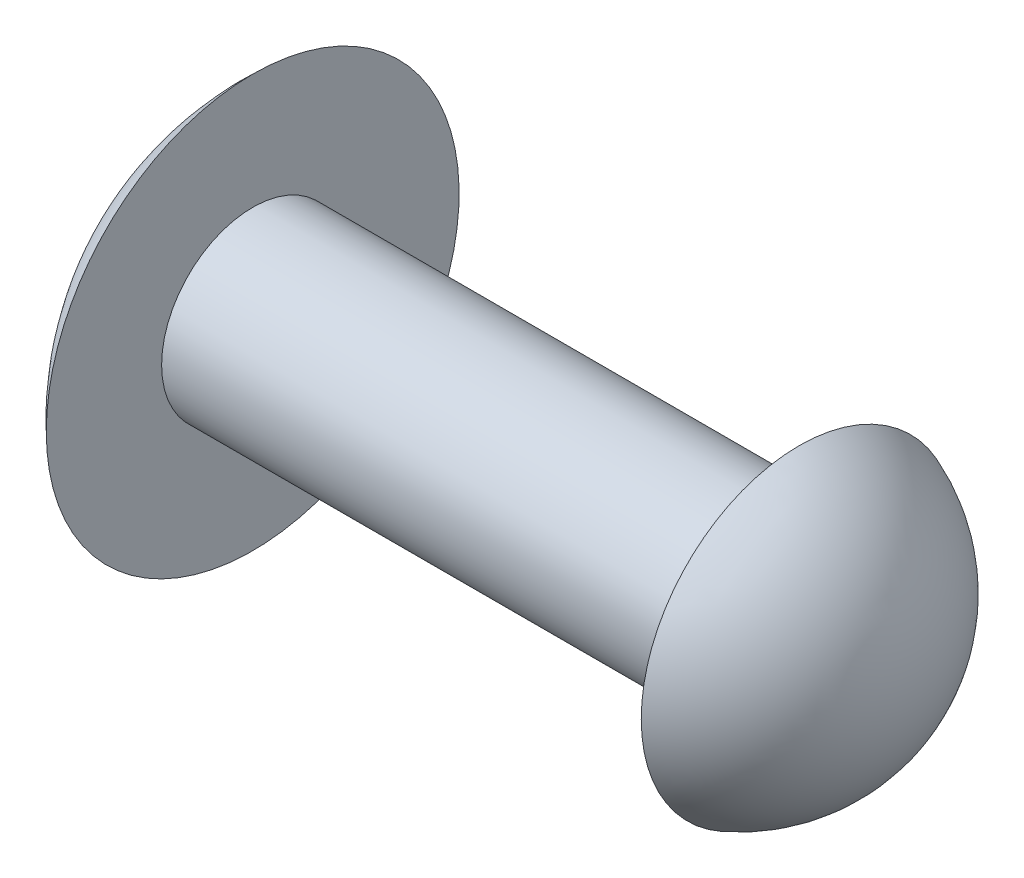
ISO-10303-21;
HEADER;
FILE_DESCRIPTION(('STEP AP214'),'2;1');
FILE_NAME('part.step','',(''),(''),'','','');
FILE_SCHEMA(('AUTOMOTIVE_DESIGN { 1 0 10303 214 1 1 1 1 }'));
ENDSEC;
DATA;
#1=APPLICATION_CONTEXT('core data for automotive mechanical design processes');
#2=APPLICATION_PROTOCOL_DEFINITION('international standard','automotive_design',2000,#1);
#3=PRODUCT_CONTEXT('',#1,'mechanical');
#4=PRODUCT('Part','Part','',(#3));
#5=PRODUCT_RELATED_PRODUCT_CATEGORY('part','',(#4));
#6=PRODUCT_DEFINITION_FORMATION('','',#4);
#7=PRODUCT_DEFINITION_CONTEXT('part definition',#1,'design');
#8=PRODUCT_DEFINITION('design','',#6,#7);
#9=PRODUCT_DEFINITION_SHAPE('','',#8);
#10=(LENGTH_UNIT() NAMED_UNIT(*) SI_UNIT(.MILLI.,.METRE.));
#11=(NAMED_UNIT(*) PLANE_ANGLE_UNIT() SI_UNIT($,.RADIAN.));
#12=(NAMED_UNIT(*) SI_UNIT($,.STERADIAN.) SOLID_ANGLE_UNIT());
#13=UNCERTAINTY_MEASURE_WITH_UNIT(LENGTH_MEASURE(1.E-05),#10,'distance_accuracy_value','');
#14=(GEOMETRIC_REPRESENTATION_CONTEXT(3) GLOBAL_UNCERTAINTY_ASSIGNED_CONTEXT((#13)) GLOBAL_UNIT_ASSIGNED_CONTEXT((#10,
#11,#12)) REPRESENTATION_CONTEXT('',''));
#15=CARTESIAN_POINT('',(0.,0.,0.));
#16=DIRECTION('',(0.,0.,1.));
#17=DIRECTION('',(1.,0.,0.));
#18=AXIS2_PLACEMENT_3D('',#15,#16,#17);
#19=CARTESIAN_POINT('',(-39.,0.,0.));
#20=DIRECTION('',(-1.,0.,0.));
#21=DIRECTION('',(0.,0.,1.));
#22=AXIS2_PLACEMENT_3D('',#19,#20,#21);
#23=CYLINDRICAL_SURFACE('',#22,1.5);
#24=CARTESIAN_POINT('',(-9.,0.,0.));
#25=DIRECTION('',(-1.,0.,0.));
#26=DIRECTION('',(0.,0.,1.));
#27=AXIS2_PLACEMENT_3D('',#24,#25,#26);
#28=CIRCLE('',#27,1.5);
#29=CARTESIAN_POINT('',(-9.,0.,1.5));
#30=VERTEX_POINT('',#29);
#31=EDGE_CURVE('E10',#30,#30,#28,.T.);
#32=ORIENTED_EDGE('',*,*,#31,.F.);
#33=EDGE_LOOP('',(#32));
#34=FACE_BOUND('',#33,.T.);
#35=CARTESIAN_POINT('',(0.,0.,0.));
#36=DIRECTION('',(1.,0.,0.));
#37=DIRECTION('',(0.,0.,-1.));
#38=AXIS2_PLACEMENT_3D('',#35,#36,#37);
#39=CIRCLE('',#38,1.5);
#40=CARTESIAN_POINT('',(0.,0.,-1.5));
#41=VERTEX_POINT('',#40);
#42=EDGE_CURVE('E39',#41,#41,#39,.T.);
#43=ORIENTED_EDGE('',*,*,#42,.F.);
#44=EDGE_LOOP('',(#43));
#45=FACE_BOUND('',#44,.T.);
#46=ADVANCED_FACE('F29',(#34,#45),#23,.T.);
#47=CARTESIAN_POINT('',(-9.,1.5,0.));
#48=DIRECTION('',(-1.,0.,0.));
#49=DIRECTION('',(0.,0.,1.));
#50=AXIS2_PLACEMENT_3D('',#47,#48,#49);
#51=PLANE('',#50);
#52=CARTESIAN_POINT('',(-9.,0.,0.));
#53=DIRECTION('',(-1.,0.,0.));
#54=DIRECTION('',(0.,0.,1.));
#55=AXIS2_PLACEMENT_3D('',#52,#53,#54);
#56=CIRCLE('',#55,3.4);
#57=CARTESIAN_POINT('',(-9.,0.,3.4));
#58=VERTEX_POINT('',#57);
#59=EDGE_CURVE('E35',#58,#58,#56,.T.);
#60=ORIENTED_EDGE('',*,*,#59,.F.);
#61=EDGE_LOOP('',(#60));
#62=FACE_BOUND('',#61,.T.);
#63=ORIENTED_EDGE('',*,*,#31,.T.);
#64=EDGE_LOOP('',(#63));
#65=FACE_BOUND('',#64,.T.);
#66=ADVANCED_FACE('F61',(#62,#65),#51,.F.);
#67=CARTESIAN_POINT('',(-5.89666666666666,0.,0.));
#68=DIRECTION('',(-1.,0.,0.));
#69=DIRECTION('',(0.,1.,0.));
#70=AXIS2_PLACEMENT_3D('',#67,#68,#69);
#71=SPHERICAL_SURFACE('',#70,4.60333333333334);
#72=ORIENTED_EDGE('',*,*,#59,.T.);
#73=EDGE_LOOP('',(#72));
#74=FACE_BOUND('',#73,.T.);
#75=ADVANCED_FACE('F58',(#74),#71,.T.);
#76=CARTESIAN_POINT('',(0.,0.,0.));
#77=DIRECTION('',(1.,0.,0.));
#78=DIRECTION('',(0.,0.,-1.));
#79=AXIS2_PLACEMENT_3D('',#76,#77,#78);
#80=PLANE('',#79);
#81=CARTESIAN_POINT('',(0.,0.,0.));
#82=DIRECTION('',(-1.,0.,0.));
#83=DIRECTION('',(0.,0.,1.));
#84=AXIS2_PLACEMENT_3D('',#81,#82,#83);
#85=CIRCLE('',#84,2.6);
#86=CARTESIAN_POINT('',(0.,0.,2.6));
#87=VERTEX_POINT('',#86);
#88=EDGE_CURVE('E43',#87,#87,#85,.T.);
#89=ORIENTED_EDGE('',*,*,#88,.T.);
#90=EDGE_LOOP('',(#89));
#91=FACE_BOUND('',#90,.T.);
#92=ORIENTED_EDGE('',*,*,#42,.T.);
#93=EDGE_LOOP('',(#92));
#94=FACE_BOUND('',#93,.T.);
#95=ADVANCED_FACE('F49',(#91,#94),#80,.F.);
#96=CARTESIAN_POINT('',(-0.977777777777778,0.,0.));
#97=DIRECTION('',(-1.,0.,0.));
#98=DIRECTION('',(0.,1.,0.));
#99=AXIS2_PLACEMENT_3D('',#96,#97,#98);
#100=SPHERICAL_SURFACE('',#99,2.77777777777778);
#101=ORIENTED_EDGE('',*,*,#88,.F.);
#102=EDGE_LOOP('',(#101));
#103=FACE_BOUND('',#102,.T.);
#104=ADVANCED_FACE('F52',(#103),#100,.T.);
#105=CLOSED_SHELL('',(#46,#66,#75,#95,#104));
#106=MANIFOLD_SOLID_BREP('B2',#105);
#107=ADVANCED_BREP_SHAPE_REPRESENTATION('',(#18,#106),#14);
#108=SHAPE_DEFINITION_REPRESENTATION(#9,#107);
ENDSEC;
END-ISO-10303-21;
